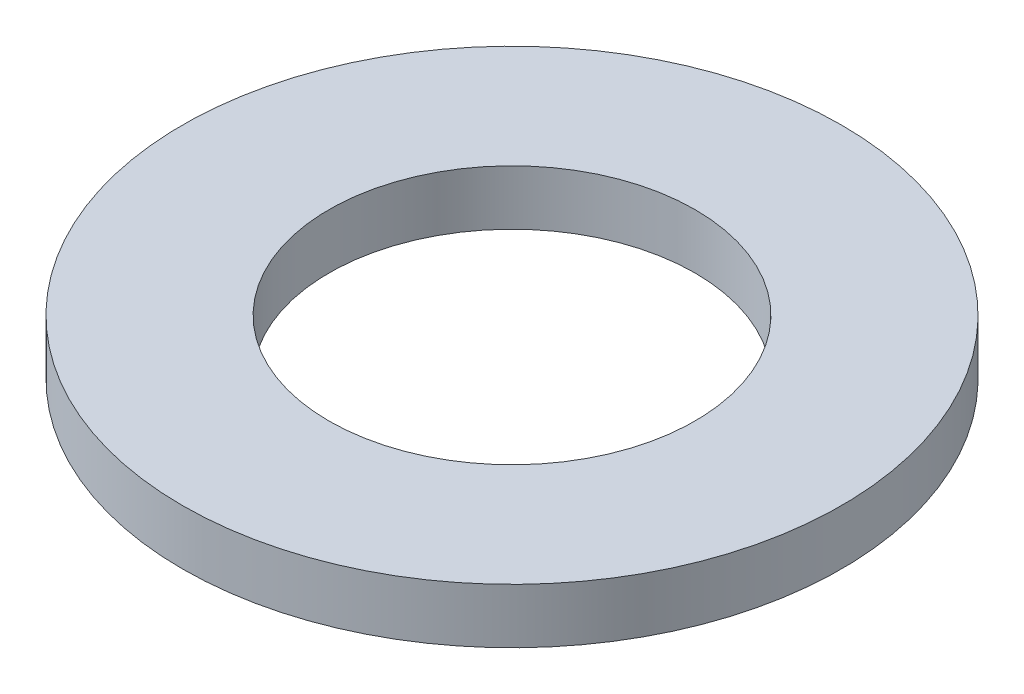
ISO-10303-21;
HEADER;
FILE_DESCRIPTION(('STEP AP214'),'2;1');
FILE_NAME('part.step','',(''),(''),'','','');
FILE_SCHEMA(('AUTOMOTIVE_DESIGN { 1 0 10303 214 1 1 1 1 }'));
ENDSEC;
DATA;
#1=APPLICATION_CONTEXT('core data for automotive mechanical design processes');
#2=APPLICATION_PROTOCOL_DEFINITION('international standard','automotive_design',2000,#1);
#3=PRODUCT_CONTEXT('',#1,'mechanical');
#4=PRODUCT('Part','Part','',(#3));
#5=PRODUCT_RELATED_PRODUCT_CATEGORY('part','',(#4));
#6=PRODUCT_DEFINITION_FORMATION('','',#4);
#7=PRODUCT_DEFINITION_CONTEXT('part definition',#1,'design');
#8=PRODUCT_DEFINITION('design','',#6,#7);
#9=PRODUCT_DEFINITION_SHAPE('','',#8);
#10=(LENGTH_UNIT() NAMED_UNIT(*) SI_UNIT(.MILLI.,.METRE.));
#11=(NAMED_UNIT(*) PLANE_ANGLE_UNIT() SI_UNIT($,.RADIAN.));
#12=(NAMED_UNIT(*) SI_UNIT($,.STERADIAN.) SOLID_ANGLE_UNIT());
#13=UNCERTAINTY_MEASURE_WITH_UNIT(LENGTH_MEASURE(1.E-05),#10,'distance_accuracy_value','');
#14=(GEOMETRIC_REPRESENTATION_CONTEXT(3) GLOBAL_UNCERTAINTY_ASSIGNED_CONTEXT((#13)) GLOBAL_UNIT_ASSIGNED_CONTEXT((#10,
#11,#12)) REPRESENTATION_CONTEXT('',''));
#15=CARTESIAN_POINT('',(0.,0.,0.));
#16=DIRECTION('',(0.,0.,1.));
#17=DIRECTION('',(1.,0.,0.));
#18=AXIS2_PLACEMENT_3D('',#15,#16,#17);
#19=CARTESIAN_POINT('',(0.,6.,0.));
#20=DIRECTION('',(0.,1.,0.));
#21=DIRECTION('',(0.,0.,1.));
#22=AXIS2_PLACEMENT_3D('',#19,#20,#21);
#23=PLANE('',#22);
#24=CARTESIAN_POINT('',(0.,6.,0.));
#25=DIRECTION('',(0.,1.,0.));
#26=DIRECTION('',(0.,0.,1.));
#27=AXIS2_PLACEMENT_3D('',#24,#25,#26);
#28=CIRCLE('',#27,36.);
#29=CARTESIAN_POINT('',(0.,6.,36.));
#30=VERTEX_POINT('',#29);
#31=EDGE_CURVE('E10',#30,#30,#28,.T.);
#32=ORIENTED_EDGE('',*,*,#31,.T.);
#33=EDGE_LOOP('',(#32));
#34=FACE_BOUND('',#33,.T.);
#35=CARTESIAN_POINT('',(0.,6.,0.));
#36=DIRECTION('',(0.,1.,0.));
#37=DIRECTION('',(0.,0.,1.));
#38=AXIS2_PLACEMENT_3D('',#35,#36,#37);
#39=CIRCLE('',#38,20.);
#40=CARTESIAN_POINT('',(0.,6.,20.));
#41=VERTEX_POINT('',#40);
#42=EDGE_CURVE('E39',#41,#41,#39,.T.);
#43=ORIENTED_EDGE('',*,*,#42,.F.);
#44=EDGE_LOOP('',(#43));
#45=FACE_BOUND('',#44,.T.);
#46=ADVANCED_FACE('F28',(#34,#45),#23,.T.);
#47=CARTESIAN_POINT('',(0.,0.,0.));
#48=DIRECTION('',(0.,1.,0.));
#49=DIRECTION('',(0.,0.,1.));
#50=AXIS2_PLACEMENT_3D('',#47,#48,#49);
#51=PLANE('',#50);
#52=CARTESIAN_POINT('',(0.,0.,0.));
#53=DIRECTION('',(0.,1.,0.));
#54=DIRECTION('',(0.,0.,1.));
#55=AXIS2_PLACEMENT_3D('',#52,#53,#54);
#56=CIRCLE('',#55,36.);
#57=CARTESIAN_POINT('',(0.,0.,36.));
#58=VERTEX_POINT('',#57);
#59=EDGE_CURVE('E35',#58,#58,#56,.T.);
#60=ORIENTED_EDGE('',*,*,#59,.F.);
#61=EDGE_LOOP('',(#60));
#62=FACE_BOUND('',#61,.T.);
#63=CARTESIAN_POINT('',(0.,0.,0.));
#64=DIRECTION('',(0.,1.,0.));
#65=DIRECTION('',(0.,0.,1.));
#66=AXIS2_PLACEMENT_3D('',#63,#64,#65);
#67=CIRCLE('',#66,20.);
#68=CARTESIAN_POINT('',(0.,0.,20.));
#69=VERTEX_POINT('',#68);
#70=EDGE_CURVE('E43',#69,#69,#67,.T.);
#71=ORIENTED_EDGE('',*,*,#70,.T.);
#72=EDGE_LOOP('',(#71));
#73=FACE_BOUND('',#72,.T.);
#74=ADVANCED_FACE('F49',(#62,#73),#51,.F.);
#75=CARTESIAN_POINT('',(0.,6.,0.));
#76=DIRECTION('',(0.,-1.,0.));
#77=DIRECTION('',(0.,0.,-1.));
#78=AXIS2_PLACEMENT_3D('',#75,#76,#77);
#79=CYLINDRICAL_SURFACE('',#78,36.);
#80=ORIENTED_EDGE('',*,*,#31,.F.);
#81=EDGE_LOOP('',(#80));
#82=FACE_BOUND('',#81,.T.);
#83=ORIENTED_EDGE('',*,*,#59,.T.);
#84=EDGE_LOOP('',(#83));
#85=FACE_BOUND('',#84,.T.);
#86=ADVANCED_FACE('F30',(#82,#85),#79,.T.);
#87=CARTESIAN_POINT('',(0.,6.,0.));
#88=DIRECTION('',(0.,-1.,0.));
#89=DIRECTION('',(0.,0.,-1.));
#90=AXIS2_PLACEMENT_3D('',#87,#88,#89);
#91=CYLINDRICAL_SURFACE('',#90,20.);
#92=ORIENTED_EDGE('',*,*,#42,.T.);
#93=EDGE_LOOP('',(#92));
#94=FACE_BOUND('',#93,.T.);
#95=ORIENTED_EDGE('',*,*,#70,.F.);
#96=EDGE_LOOP('',(#95));
#97=FACE_BOUND('',#96,.T.);
#98=ADVANCED_FACE('F51',(#94,#97),#91,.F.);
#99=CLOSED_SHELL('',(#46,#74,#86,#98));
#100=MANIFOLD_SOLID_BREP('B2',#99);
#101=ADVANCED_BREP_SHAPE_REPRESENTATION('',(#18,#100),#14);
#102=SHAPE_DEFINITION_REPRESENTATION(#9,#101);
ENDSEC;
END-ISO-10303-21;
